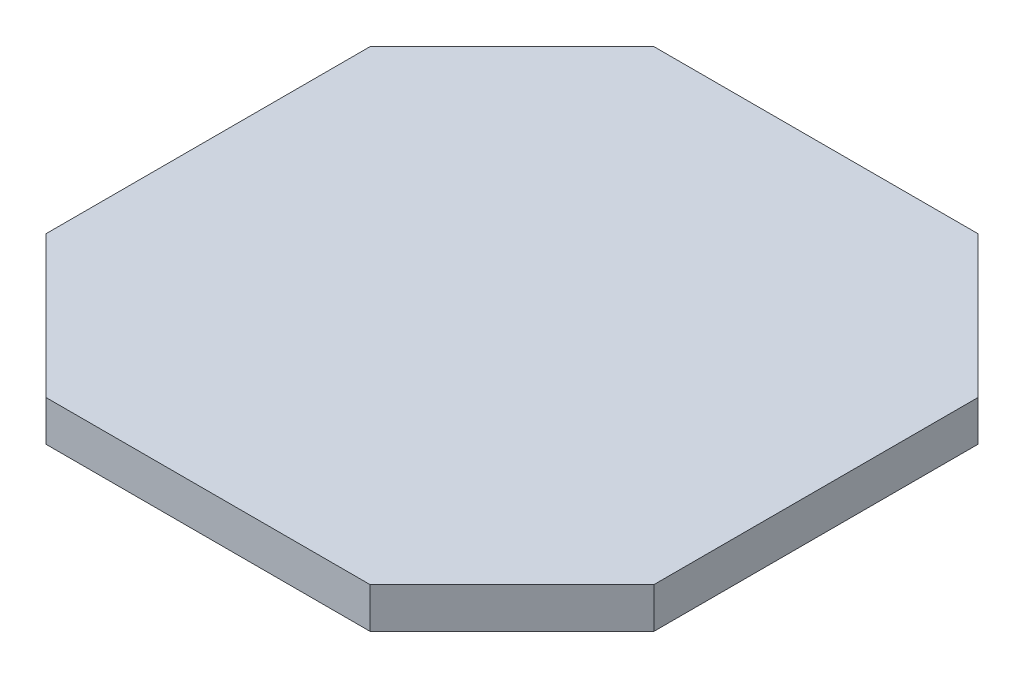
ISO-10303-21;
HEADER;
FILE_DESCRIPTION(('STEP AP214'),'2;1');
FILE_NAME('part.step','',(''),(''),'','','');
FILE_SCHEMA(('AUTOMOTIVE_DESIGN { 1 0 10303 214 1 1 1 1 }'));
ENDSEC;
DATA;
#1=APPLICATION_CONTEXT('core data for automotive mechanical design processes');
#2=APPLICATION_PROTOCOL_DEFINITION('international standard','automotive_design',2000,#1);
#3=PRODUCT_CONTEXT('',#1,'mechanical');
#4=PRODUCT('Part','Part','',(#3));
#5=PRODUCT_RELATED_PRODUCT_CATEGORY('part','',(#4));
#6=PRODUCT_DEFINITION_FORMATION('','',#4);
#7=PRODUCT_DEFINITION_CONTEXT('part definition',#1,'design');
#8=PRODUCT_DEFINITION('design','',#6,#7);
#9=PRODUCT_DEFINITION_SHAPE('','',#8);
#10=(LENGTH_UNIT() NAMED_UNIT(*) SI_UNIT(.MILLI.,.METRE.));
#11=(NAMED_UNIT(*) PLANE_ANGLE_UNIT() SI_UNIT($,.RADIAN.));
#12=(NAMED_UNIT(*) SI_UNIT($,.STERADIAN.) SOLID_ANGLE_UNIT());
#13=UNCERTAINTY_MEASURE_WITH_UNIT(LENGTH_MEASURE(1.E-05),#10,'distance_accuracy_value','');
#14=(GEOMETRIC_REPRESENTATION_CONTEXT(3) GLOBAL_UNCERTAINTY_ASSIGNED_CONTEXT((#13)) GLOBAL_UNIT_ASSIGNED_CONTEXT((#10,
#11,#12)) REPRESENTATION_CONTEXT('',''));
#15=CARTESIAN_POINT('',(0.,0.,0.));
#16=DIRECTION('',(0.,0.,1.));
#17=DIRECTION('',(1.,0.,0.));
#18=AXIS2_PLACEMENT_3D('',#15,#16,#17);
#19=CARTESIAN_POINT('',(10.16,2.54,-19.05));
#20=DIRECTION('',(-0.707106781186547,0.,0.707106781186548));
#21=DIRECTION('',(0.707106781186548,0.,0.707106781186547));
#22=AXIS2_PLACEMENT_3D('',#19,#20,#21);
#23=PLANE('',#22);
#24=DIRECTION('',(-0.707106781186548,0.,-0.707106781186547));
#25=VECTOR('',#24,1.);
#26=CARTESIAN_POINT('',(10.16,0.,-19.05));
#27=LINE('',#26,#25);
#28=CARTESIAN_POINT('',(19.05,0.,-10.16));
#29=VERTEX_POINT('',#28);
#30=CARTESIAN_POINT('',(10.16,0.,-19.05));
#31=VERTEX_POINT('',#30);
#32=EDGE_CURVE('E104',#29,#31,#27,.T.);
#33=ORIENTED_EDGE('',*,*,#32,.T.);
#34=DIRECTION('',(0.,-1.,0.));
#35=VECTOR('',#34,1.);
#36=CARTESIAN_POINT('',(10.16,2.54,-19.05));
#37=LINE('',#36,#35);
#38=CARTESIAN_POINT('',(10.16,2.54,-19.05));
#39=VERTEX_POINT('',#38);
#40=EDGE_CURVE('E37',#39,#31,#37,.T.);
#41=ORIENTED_EDGE('',*,*,#40,.F.);
#42=DIRECTION('',(-0.707106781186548,0.,-0.707106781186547));
#43=VECTOR('',#42,1.);
#44=CARTESIAN_POINT('',(10.16,2.54,-19.05));
#45=LINE('',#44,#43);
#46=CARTESIAN_POINT('',(19.05,2.54,-10.16));
#47=VERTEX_POINT('',#46);
#48=EDGE_CURVE('E112',#47,#39,#45,.T.);
#49=ORIENTED_EDGE('',*,*,#48,.F.);
#50=DIRECTION('',(0.,-1.,0.));
#51=VECTOR('',#50,1.);
#52=CARTESIAN_POINT('',(19.05,2.54,-10.16));
#53=LINE('',#52,#51);
#54=EDGE_CURVE('E11',#47,#29,#53,.T.);
#55=ORIENTED_EDGE('',*,*,#54,.T.);
#56=EDGE_LOOP('',(#33,#41,#49,#55));
#57=FACE_BOUND('',#56,.T.);
#58=ADVANCED_FACE('F30',(#57),#23,.F.);
#59=CARTESIAN_POINT('',(10.16,2.54,-19.05));
#60=DIRECTION('',(0.,0.,1.));
#61=DIRECTION('',(1.,0.,0.));
#62=AXIS2_PLACEMENT_3D('',#59,#60,#61);
#63=PLANE('',#62);
#64=DIRECTION('',(-1.,0.,0.));
#65=VECTOR('',#64,1.);
#66=CARTESIAN_POINT('',(10.16,0.,-19.05));
#67=LINE('',#66,#65);
#68=CARTESIAN_POINT('',(-10.16,0.,-19.05));
#69=VERTEX_POINT('',#68);
#70=EDGE_CURVE('E107',#31,#69,#67,.T.);
#71=ORIENTED_EDGE('',*,*,#70,.T.);
#72=DIRECTION('',(0.,-1.,0.));
#73=VECTOR('',#72,1.);
#74=CARTESIAN_POINT('',(-10.16,2.54,-19.05));
#75=LINE('',#74,#73);
#76=CARTESIAN_POINT('',(-10.16,2.54,-19.05));
#77=VERTEX_POINT('',#76);
#78=EDGE_CURVE('E144',#77,#69,#75,.T.);
#79=ORIENTED_EDGE('',*,*,#78,.F.);
#80=DIRECTION('',(-1.,0.,0.));
#81=VECTOR('',#80,1.);
#82=CARTESIAN_POINT('',(10.16,2.54,-19.05));
#83=LINE('',#82,#81);
#84=EDGE_CURVE('E114',#39,#77,#83,.T.);
#85=ORIENTED_EDGE('',*,*,#84,.F.);
#86=ORIENTED_EDGE('',*,*,#40,.T.);
#87=EDGE_LOOP('',(#71,#79,#85,#86));
#88=FACE_BOUND('',#87,.T.);
#89=ADVANCED_FACE('F147',(#88),#63,.F.);
#90=CARTESIAN_POINT('',(-10.16,2.54,-19.05));
#91=DIRECTION('',(0.707106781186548,0.,0.707106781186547));
#92=DIRECTION('',(0.707106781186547,0.,-0.707106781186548));
#93=AXIS2_PLACEMENT_3D('',#90,#91,#92);
#94=PLANE('',#93);
#95=DIRECTION('',(-0.707106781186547,0.,0.707106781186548));
#96=VECTOR('',#95,1.);
#97=CARTESIAN_POINT('',(-10.16,0.,-19.05));
#98=LINE('',#97,#96);
#99=CARTESIAN_POINT('',(-19.05,0.,-10.16));
#100=VERTEX_POINT('',#99);
#101=EDGE_CURVE('E156',#69,#100,#98,.T.);
#102=ORIENTED_EDGE('',*,*,#101,.T.);
#103=DIRECTION('',(0.,-1.,0.));
#104=VECTOR('',#103,1.);
#105=CARTESIAN_POINT('',(-19.05,2.54,-10.16));
#106=LINE('',#105,#104);
#107=CARTESIAN_POINT('',(-19.05,2.54,-10.16));
#108=VERTEX_POINT('',#107);
#109=EDGE_CURVE('E141',#108,#100,#106,.T.);
#110=ORIENTED_EDGE('',*,*,#109,.F.);
#111=DIRECTION('',(-0.707106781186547,0.,0.707106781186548));
#112=VECTOR('',#111,1.);
#113=CARTESIAN_POINT('',(-10.16,2.54,-19.05));
#114=LINE('',#113,#112);
#115=EDGE_CURVE('E123',#77,#108,#114,.T.);
#116=ORIENTED_EDGE('',*,*,#115,.F.);
#117=ORIENTED_EDGE('',*,*,#78,.T.);
#118=EDGE_LOOP('',(#102,#110,#116,#117));
#119=FACE_BOUND('',#118,.T.);
#120=ADVANCED_FACE('F155',(#119),#94,.F.);
#121=CARTESIAN_POINT('',(-19.05,2.54,0.));
#122=DIRECTION('',(1.,0.,0.));
#123=DIRECTION('',(0.,0.,-1.));
#124=AXIS2_PLACEMENT_3D('',#121,#122,#123);
#125=PLANE('',#124);
#126=DIRECTION('',(0.,0.,1.));
#127=VECTOR('',#126,1.);
#128=CARTESIAN_POINT('',(-19.05,0.,0.));
#129=LINE('',#128,#127);
#130=CARTESIAN_POINT('',(-19.05,0.,10.16));
#131=VERTEX_POINT('',#130);
#132=EDGE_CURVE('E160',#100,#131,#129,.T.);
#133=ORIENTED_EDGE('',*,*,#132,.T.);
#134=DIRECTION('',(0.,-1.,0.));
#135=VECTOR('',#134,1.);
#136=CARTESIAN_POINT('',(-19.05,2.54,10.16));
#137=LINE('',#136,#135);
#138=CARTESIAN_POINT('',(-19.05,2.54,10.16));
#139=VERTEX_POINT('',#138);
#140=EDGE_CURVE('E138',#139,#131,#137,.T.);
#141=ORIENTED_EDGE('',*,*,#140,.F.);
#142=DIRECTION('',(0.,0.,1.));
#143=VECTOR('',#142,1.);
#144=CARTESIAN_POINT('',(-19.05,2.54,0.));
#145=LINE('',#144,#143);
#146=EDGE_CURVE('E125',#108,#139,#145,.T.);
#147=ORIENTED_EDGE('',*,*,#146,.F.);
#148=ORIENTED_EDGE('',*,*,#109,.T.);
#149=EDGE_LOOP('',(#133,#141,#147,#148));
#150=FACE_BOUND('',#149,.T.);
#151=ADVANCED_FACE('F158',(#150),#125,.F.);
#152=CARTESIAN_POINT('',(-10.16,2.54,19.05));
#153=DIRECTION('',(0.707106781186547,0.,-0.707106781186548));
#154=DIRECTION('',(-0.707106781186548,0.,-0.707106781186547));
#155=AXIS2_PLACEMENT_3D('',#152,#153,#154);
#156=PLANE('',#155);
#157=DIRECTION('',(0.707106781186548,0.,0.707106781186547));
#158=VECTOR('',#157,1.);
#159=CARTESIAN_POINT('',(-10.16,0.,19.05));
#160=LINE('',#159,#158);
#161=CARTESIAN_POINT('',(-10.16,0.,19.05));
#162=VERTEX_POINT('',#161);
#163=EDGE_CURVE('E165',#131,#162,#160,.T.);
#164=ORIENTED_EDGE('',*,*,#163,.T.);
#165=DIRECTION('',(0.,-1.,0.));
#166=VECTOR('',#165,1.);
#167=CARTESIAN_POINT('',(-10.16,2.54,19.05));
#168=LINE('',#167,#166);
#169=CARTESIAN_POINT('',(-10.16,2.54,19.05));
#170=VERTEX_POINT('',#169);
#171=EDGE_CURVE('E135',#170,#162,#168,.T.);
#172=ORIENTED_EDGE('',*,*,#171,.F.);
#173=DIRECTION('',(0.707106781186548,0.,0.707106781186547));
#174=VECTOR('',#173,1.);
#175=CARTESIAN_POINT('',(-10.16,2.54,19.05));
#176=LINE('',#175,#174);
#177=EDGE_CURVE('E127',#139,#170,#176,.T.);
#178=ORIENTED_EDGE('',*,*,#177,.F.);
#179=ORIENTED_EDGE('',*,*,#140,.T.);
#180=EDGE_LOOP('',(#164,#172,#178,#179));
#181=FACE_BOUND('',#180,.T.);
#182=ADVANCED_FACE('F164',(#181),#156,.F.);
#183=CARTESIAN_POINT('',(10.16,2.54,19.05));
#184=DIRECTION('',(0.,0.,-1.));
#185=DIRECTION('',(-1.,0.,0.));
#186=AXIS2_PLACEMENT_3D('',#183,#184,#185);
#187=PLANE('',#186);
#188=DIRECTION('',(1.,0.,0.));
#189=VECTOR('',#188,1.);
#190=CARTESIAN_POINT('',(10.16,0.,19.05));
#191=LINE('',#190,#189);
#192=CARTESIAN_POINT('',(10.16,0.,19.05));
#193=VERTEX_POINT('',#192);
#194=EDGE_CURVE('E169',#162,#193,#191,.T.);
#195=ORIENTED_EDGE('',*,*,#194,.T.);
#196=DIRECTION('',(0.,-1.,0.));
#197=VECTOR('',#196,1.);
#198=CARTESIAN_POINT('',(10.16,2.54,19.05));
#199=LINE('',#198,#197);
#200=CARTESIAN_POINT('',(10.16,2.54,19.05));
#201=VERTEX_POINT('',#200);
#202=EDGE_CURVE('E132',#201,#193,#199,.T.);
#203=ORIENTED_EDGE('',*,*,#202,.F.);
#204=DIRECTION('',(1.,0.,0.));
#205=VECTOR('',#204,1.);
#206=CARTESIAN_POINT('',(10.16,2.54,19.05));
#207=LINE('',#206,#205);
#208=EDGE_CURVE('E51',#170,#201,#207,.T.);
#209=ORIENTED_EDGE('',*,*,#208,.F.);
#210=ORIENTED_EDGE('',*,*,#171,.T.);
#211=EDGE_LOOP('',(#195,#203,#209,#210));
#212=FACE_BOUND('',#211,.T.);
#213=ADVANCED_FACE('F168',(#212),#187,.F.);
#214=CARTESIAN_POINT('',(10.16,2.54,19.05));
#215=DIRECTION('',(-0.707106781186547,0.,-0.707106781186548));
#216=DIRECTION('',(-0.707106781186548,0.,0.707106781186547));
#217=AXIS2_PLACEMENT_3D('',#214,#215,#216);
#218=PLANE('',#217);
#219=DIRECTION('',(0.707106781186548,0.,-0.707106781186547));
#220=VECTOR('',#219,1.);
#221=CARTESIAN_POINT('',(10.16,0.,19.05));
#222=LINE('',#221,#220);
#223=CARTESIAN_POINT('',(19.05,0.,10.16));
#224=VERTEX_POINT('',#223);
#225=EDGE_CURVE('E101',#193,#224,#222,.T.);
#226=ORIENTED_EDGE('',*,*,#225,.T.);
#227=DIRECTION('',(0.,-1.,0.));
#228=VECTOR('',#227,1.);
#229=CARTESIAN_POINT('',(19.05,2.54,10.16));
#230=LINE('',#229,#228);
#231=CARTESIAN_POINT('',(19.05,2.54,10.16));
#232=VERTEX_POINT('',#231);
#233=EDGE_CURVE('E98',#232,#224,#230,.T.);
#234=ORIENTED_EDGE('',*,*,#233,.F.);
#235=DIRECTION('',(0.707106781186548,0.,-0.707106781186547));
#236=VECTOR('',#235,1.);
#237=CARTESIAN_POINT('',(10.16,2.54,19.05));
#238=LINE('',#237,#236);
#239=EDGE_CURVE('E118',#201,#232,#238,.T.);
#240=ORIENTED_EDGE('',*,*,#239,.F.);
#241=ORIENTED_EDGE('',*,*,#202,.T.);
#242=EDGE_LOOP('',(#226,#234,#240,#241));
#243=FACE_BOUND('',#242,.T.);
#244=ADVANCED_FACE('F171',(#243),#218,.F.);
#245=CARTESIAN_POINT('',(19.05,2.54,0.));
#246=DIRECTION('',(-1.,0.,0.));
#247=DIRECTION('',(0.,0.,1.));
#248=AXIS2_PLACEMENT_3D('',#245,#246,#247);
#249=PLANE('',#248);
#250=DIRECTION('',(0.,0.,-1.));
#251=VECTOR('',#250,1.);
#252=CARTESIAN_POINT('',(19.05,0.,0.));
#253=LINE('',#252,#251);
#254=EDGE_CURVE('E94',#224,#29,#253,.T.);
#255=ORIENTED_EDGE('',*,*,#254,.T.);
#256=ORIENTED_EDGE('',*,*,#54,.F.);
#257=DIRECTION('',(0.,0.,-1.));
#258=VECTOR('',#257,1.);
#259=CARTESIAN_POINT('',(19.05,2.54,0.));
#260=LINE('',#259,#258);
#261=EDGE_CURVE('E44',#232,#47,#260,.T.);
#262=ORIENTED_EDGE('',*,*,#261,.F.);
#263=ORIENTED_EDGE('',*,*,#233,.T.);
#264=EDGE_LOOP('',(#255,#256,#262,#263));
#265=FACE_BOUND('',#264,.T.);
#266=ADVANCED_FACE('F96',(#265),#249,.F.);
#267=CARTESIAN_POINT('',(19.05,2.54,-19.05));
#268=DIRECTION('',(0.,1.,0.));
#269=DIRECTION('',(0.,0.,1.));
#270=AXIS2_PLACEMENT_3D('',#267,#268,#269);
#271=PLANE('',#270);
#272=ORIENTED_EDGE('',*,*,#261,.T.);
#273=ORIENTED_EDGE('',*,*,#48,.T.);
#274=ORIENTED_EDGE('',*,*,#84,.T.);
#275=ORIENTED_EDGE('',*,*,#115,.T.);
#276=ORIENTED_EDGE('',*,*,#146,.T.);
#277=ORIENTED_EDGE('',*,*,#177,.T.);
#278=ORIENTED_EDGE('',*,*,#208,.T.);
#279=ORIENTED_EDGE('',*,*,#239,.T.);
#280=EDGE_LOOP('',(#272,#273,#274,#275,#276,#277,#278,#279));
#281=FACE_BOUND('',#280,.T.);
#282=ADVANCED_FACE('F116',(#281),#271,.T.);
#283=CARTESIAN_POINT('',(19.05,0.,-19.05));
#284=DIRECTION('',(0.,1.,0.));
#285=DIRECTION('',(0.,0.,1.));
#286=AXIS2_PLACEMENT_3D('',#283,#284,#285);
#287=PLANE('',#286);
#288=ORIENTED_EDGE('',*,*,#32,.F.);
#289=ORIENTED_EDGE('',*,*,#254,.F.);
#290=ORIENTED_EDGE('',*,*,#225,.F.);
#291=ORIENTED_EDGE('',*,*,#194,.F.);
#292=ORIENTED_EDGE('',*,*,#163,.F.);
#293=ORIENTED_EDGE('',*,*,#132,.F.);
#294=ORIENTED_EDGE('',*,*,#101,.F.);
#295=ORIENTED_EDGE('',*,*,#70,.F.);
#296=EDGE_LOOP('',(#288,#289,#290,#291,#292,#293,#294,#295));
#297=FACE_BOUND('',#296,.T.);
#298=ADVANCED_FACE('F105',(#297),#287,.F.);
#299=CLOSED_SHELL('',(#58,#89,#120,#151,#182,#213,#244,#266,#282,#298));
#300=MANIFOLD_SOLID_BREP('B2',#299);
#301=ADVANCED_BREP_SHAPE_REPRESENTATION('',(#18,#300),#14);
#302=SHAPE_DEFINITION_REPRESENTATION(#9,#301);
ENDSEC;
END-ISO-10303-21;
